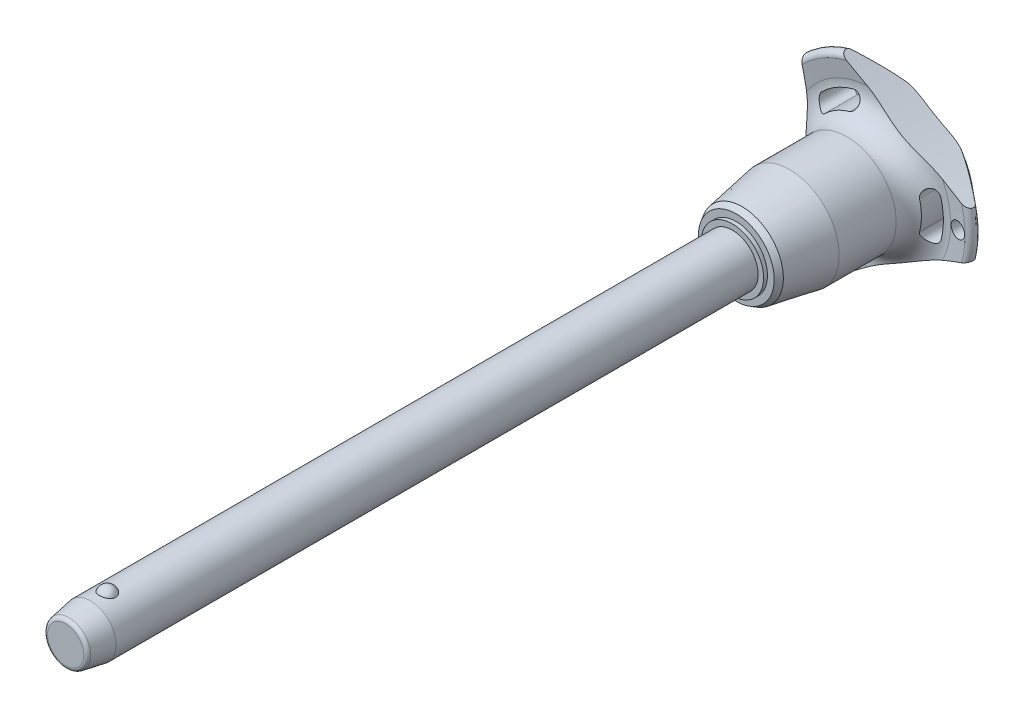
from build123d import *

# Parameters (mm, degrees)
SKETCH1_R           = 5
BOSS_EXTRUDE1_DEPTH = 120
SKETCH2_R           = 4.25
BOSS_EXTRUDE2_DEPTH = 33.3
BOSS_EXTRUDE3_START = 9.6
SKETCH1_2_R         = 5
BOSS_EXTRUDE3_DEPTH = 9.6
CHAMFER1_SIZE       = 4.8
CHAMFER1_SIZE2      = 0.846369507
FILLET1_R           = 0.75
SKETCH6_R           = 102.8
CUT_EXTRUDE1_DEPTH  = 156.789328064
CIRPATTERN1_COUNT   = 3
SKETCH7_R           = 1.5
CUT_EXTRUDE2_DEPTH  = 156.685475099


with BuildPart() as part:
    # Sketch1 → Boss-Extrude1 (new body)
    with BuildSketch(Plane.XY):
        Circle(SKETCH1_R)
    extrude(amount=-BOSS_EXTRUDE1_DEPTH)

    # Sketch2 → Boss-Extrude2 (add)
    with BuildSketch(Plane(origin=(0, 0, -120), x_dir=(-1, 0, 0), z_dir=(0, 0, -1))):
        Circle(SKETCH2_R)
    extrude(amount=BOSS_EXTRUDE2_DEPTH)

    # Sketch3 → Revolve1 (revolve)
    with BuildSketch(Plane(origin=(0, 0, 0), x_dir=(0, 0, -1), z_dir=(1, 0, 0))):
        with BuildLine():
            Line((-1.516575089, 6), (-1.516575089, 2.7))
            ThreePointArc((-1.516575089, 2.7), (0.133424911, 4.35), (-1.516575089, 6))
        make_face()
        with BuildLine():
            Line((-1.516575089, -2.7), (-1.516575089, -6))
            ThreePointArc((-1.516575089, -6), (0.133424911, -4.35), (-1.516575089, -2.7))
        make_face()
    revolve(axis=Axis((0, -2.7, 1.516575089), (0, 1, 0)))

    # Sketch1_2 → Boss-Extrude3 (add)
    with BuildSketch(Plane.XY.offset(BOSS_EXTRUDE3_START)):
        Circle(SKETCH1_2_R)
    extrude(amount=-BOSS_EXTRUDE3_DEPTH)

    # Chamfer1
    chamfer1_edges = [part.edges().sort_by_distance(p)[0] for p in [
        (-5, 0, 9.6),
    ]]
    chamfer1_side = [part.faces().sort_by_distance(p)[0] for p in [
        (-5, 0, -55.2),
    ]]
    chamfer(chamfer1_edges, length=CHAMFER1_SIZE, length2=CHAMFER1_SIZE2, reference=chamfer1_side[0])

    # Fillet1
    fillet1_edges = [part.edges().sort_by_distance(p)[0] for p in [
        (-4.153630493, 0, 9.6),
        (4.25, 0, -153.3),
    ]]
    fillet(fillet1_edges, radius=FILLET1_R)

    # Sketch4 → Revolve2 (revolve)
    with BuildSketch(Plane(origin=(0, 0, 0), x_dir=(0, 0, -1), z_dir=(1, 0, 0)), mode=Mode.PRIVATE) as revolve2_sk:
        Polygon((120, 0), (120, 6.067402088), (120.75, 6.067402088), (120.75, 7.371950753), (121.879772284, 8.024225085), (131.1, 9.65), (142.2, 9.65), (142.2, 0), align=None)
    revolve(revolve2_sk.sketch.rotate(Axis((0, 0, -142.2), (0, 0, 1)), 90), axis=Axis((0, 0, -142.2), (0, 0, 1)))

    # Sketch5 → Revolve3 (revolve)
    with BuildSketch(Plane(origin=(0, 0, 0), x_dir=(0, 0, -1), z_dir=(1, 0, 0)), mode=Mode.PRIVATE) as revolve3_sk:
        with BuildLine():
            Line((147.16082631, 15.274661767), (146.757834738, 18.475067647))
            ThreePointArc((146.757834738, 18.475067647), (147.349836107, 19.516443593), (148.516044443, 19.24278761))
            Line((148.516044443, 19.24278761), (152.835691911, 14.094832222))
            ThreePointArc((152.835691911, 14.094832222), (153.3, 12.689260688), (152.67067517, 11.349423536))
            ThreePointArc((152.67067517, 11.349423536), (149.033110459, 6.185112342), (147.75, 0))
            Line((147.75, 0), (142.2, 0))
            Line((142.2, 0), (142.2, 9.65))
            ThreePointArc((142.2, 9.65), (145.949887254, 11.342683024), (147.16082631, 15.274661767))
        make_face()
    revolve(revolve3_sk.sketch.rotate(Axis((0, 0, -147.75), (0, 0, 1)), 90), axis=Axis((0, 0, -147.75), (0, 0, 1)))

    # Sketch6 → Cut-Extrude1 (cut, through all)
    with BuildSketch(Plane.XY):
        with Locations((-115.2, 0)):
            Circle(SKETCH6_R)
        with BuildLine():
            ThreePointArc((13.411913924, -3.529271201), (13.868496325, 0), (13.411913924, 3.529271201))
            ThreePointArc((13.411913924, 3.529271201), (11.694200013, 4.531299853), (10.692171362, 2.813585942))
            ThreePointArc((10.692171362, 2.813585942), (11.056165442, 0), (10.692171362, -2.813585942))
            ThreePointArc((10.692171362, -2.813585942), (11.694200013, -4.531299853), (13.411913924, -3.529271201))
        make_face()
    cut_extrude1 = extrude(amount=-CUT_EXTRUDE1_DEPTH, mode=Mode.SUBTRACT)

    # CirPattern1: Cut-Extrude1 ×3 about axis
    cirpattern1_axis = Axis((0, 0, 0), (0, 0, 1))
    for i in range(1, CIRPATTERN1_COUNT):
        add(cut_extrude1.rotate(cirpattern1_axis, i * 360 / CIRPATTERN1_COUNT), mode=Mode.SUBTRACT)

    # Sketch7 → Cut-Extrude2 (cut, through all)
    with BuildSketch(Plane.XY):
        with Locations(Location((16.868496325, 0, 0), (0, 0, 225.467095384))):
            Circle(SKETCH7_R)
    extrude(amount=-CUT_EXTRUDE2_DEPTH, mode=Mode.SUBTRACT)


solid = part.part
